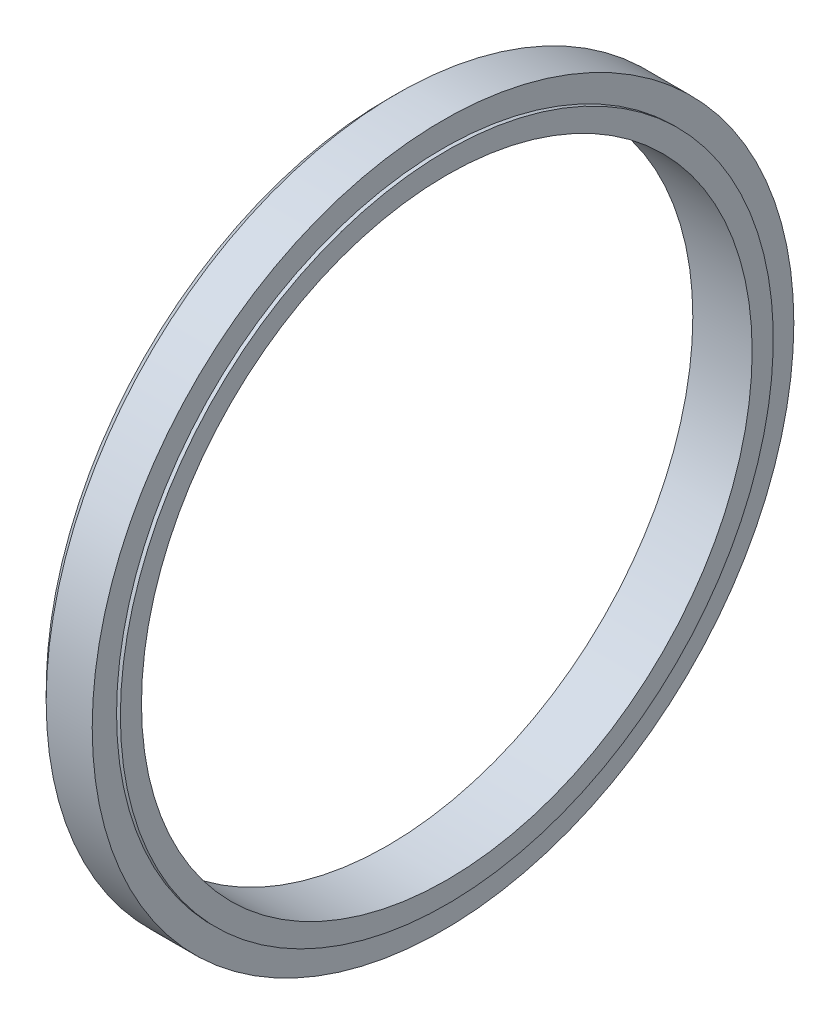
from build123d import *

# Parameters (mm, degrees)
CHAMFER1_SIZE = 0.25


with BuildPart() as part:
    # Sketch2 → Revolve1 (revolve)
    with BuildSketch(Plane.XY, mode=Mode.PRIVATE) as revolve1_sk:
        Polygon((0, 8.025), (1.56, 8.025), (1.56, 8.58), (1.46, 8.58), (1.46, 9.22), (0, 9.22), align=None)
    revolve(revolve1_sk.sketch.rotate(Axis((-2.514141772, 0, 0), (1, 0, 0)), 90), axis=Axis((-2.514141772, 0, 0), (1, 0, 0)))

    # Chamfer1
    chamfer1_edges = [part.edges().sort_by_distance(p)[0] for p in [
        (0, 0, -9.22),
    ]]
    chamfer(chamfer1_edges, length=CHAMFER1_SIZE)


solid = part.part
